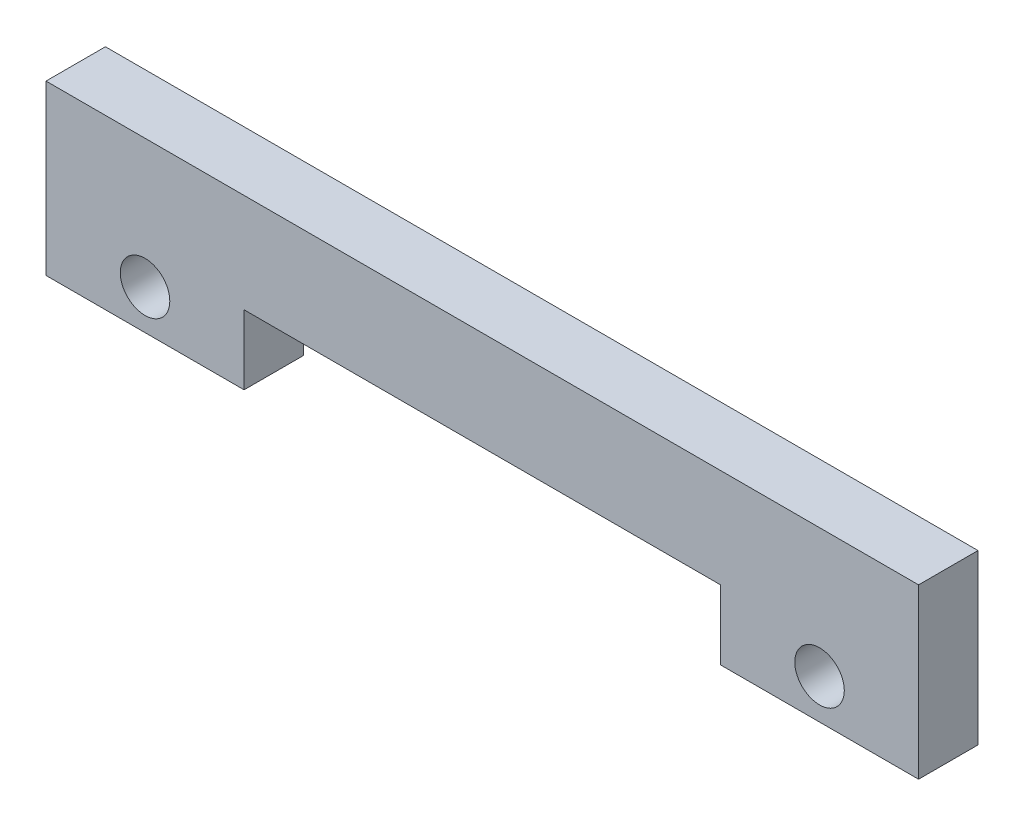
ISO-10303-21;
HEADER;
FILE_DESCRIPTION(('STEP AP214'),'2;1');
FILE_NAME('part.step','',(''),(''),'','','');
FILE_SCHEMA(('AUTOMOTIVE_DESIGN { 1 0 10303 214 1 1 1 1 }'));
ENDSEC;
DATA;
#1=APPLICATION_CONTEXT('core data for automotive mechanical design processes');
#2=APPLICATION_PROTOCOL_DEFINITION('international standard','automotive_design',2000,#1);
#3=PRODUCT_CONTEXT('',#1,'mechanical');
#4=PRODUCT('Part','Part','',(#3));
#5=PRODUCT_RELATED_PRODUCT_CATEGORY('part','',(#4));
#6=PRODUCT_DEFINITION_FORMATION('','',#4);
#7=PRODUCT_DEFINITION_CONTEXT('part definition',#1,'design');
#8=PRODUCT_DEFINITION('design','',#6,#7);
#9=PRODUCT_DEFINITION_SHAPE('','',#8);
#10=(LENGTH_UNIT() NAMED_UNIT(*) SI_UNIT(.MILLI.,.METRE.));
#11=(NAMED_UNIT(*) PLANE_ANGLE_UNIT() SI_UNIT($,.RADIAN.));
#12=(NAMED_UNIT(*) SI_UNIT($,.STERADIAN.) SOLID_ANGLE_UNIT());
#13=UNCERTAINTY_MEASURE_WITH_UNIT(LENGTH_MEASURE(1.E-05),#10,'distance_accuracy_value','');
#14=(GEOMETRIC_REPRESENTATION_CONTEXT(3) GLOBAL_UNCERTAINTY_ASSIGNED_CONTEXT((#13)) GLOBAL_UNIT_ASSIGNED_CONTEXT((#10,
#11,#12)) REPRESENTATION_CONTEXT('',''));
#15=CARTESIAN_POINT('',(0.,0.,0.));
#16=DIRECTION('',(0.,0.,1.));
#17=DIRECTION('',(1.,0.,0.));
#18=AXIS2_PLACEMENT_3D('',#15,#16,#17);
#19=CARTESIAN_POINT('',(0.,0.,3.));
#20=DIRECTION('',(0.,0.,1.));
#21=DIRECTION('',(1.,0.,0.));
#22=AXIS2_PLACEMENT_3D('',#19,#20,#21);
#23=PLANE('',#22);
#24=CARTESIAN_POINT('',(48.3612622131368,263.707308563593,3.));
#25=DIRECTION('',(0.,0.,1.));
#26=DIRECTION('',(1.,0.,0.));
#27=AXIS2_PLACEMENT_3D('',#24,#25,#26);
#28=CIRCLE('',#27,1.25);
#29=CARTESIAN_POINT('',(49.6112622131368,263.707308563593,3.));
#30=VERTEX_POINT('',#29);
#31=EDGE_CURVE('E133',#30,#30,#28,.T.);
#32=ORIENTED_EDGE('',*,*,#31,.F.);
#33=EDGE_LOOP('',(#32));
#34=FACE_BOUND('',#33,.T.);
#35=DIRECTION('',(1.,0.,0.));
#36=VECTOR('',#35,1.);
#37=CARTESIAN_POINT('',(77.4134354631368,261.707308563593,3.));
#38=LINE('',#37,#36);
#39=CARTESIAN_POINT('',(77.4134354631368,261.707308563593,3.));
#40=VERTEX_POINT('',#39);
#41=CARTESIAN_POINT('',(87.4134354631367,261.707308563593,3.));
#42=VERTEX_POINT('',#41);
#43=EDGE_CURVE('E144',#40,#42,#38,.T.);
#44=ORIENTED_EDGE('',*,*,#43,.T.);
#45=DIRECTION('',(0.,1.,0.));
#46=VECTOR('',#45,1.);
#47=CARTESIAN_POINT('',(87.4134354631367,261.707308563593,3.));
#48=LINE('',#47,#46);
#49=CARTESIAN_POINT('',(87.4134354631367,270.207308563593,3.));
#50=VERTEX_POINT('',#49);
#51=EDGE_CURVE('E92',#42,#50,#48,.T.);
#52=ORIENTED_EDGE('',*,*,#51,.T.);
#53=DIRECTION('',(-1.,0.,0.));
#54=VECTOR('',#53,1.);
#55=CARTESIAN_POINT('',(43.3612622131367,270.207308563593,3.));
#56=LINE('',#55,#54);
#57=CARTESIAN_POINT('',(43.3612622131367,270.207308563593,3.));
#58=VERTEX_POINT('',#57);
#59=EDGE_CURVE('E159',#50,#58,#56,.T.);
#60=ORIENTED_EDGE('',*,*,#59,.T.);
#61=DIRECTION('',(0.,-1.,0.));
#62=VECTOR('',#61,1.);
#63=CARTESIAN_POINT('',(43.3612622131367,261.707308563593,3.));
#64=LINE('',#63,#62);
#65=CARTESIAN_POINT('',(43.3612622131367,261.707308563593,3.));
#66=VERTEX_POINT('',#65);
#67=EDGE_CURVE('E172',#58,#66,#64,.T.);
#68=ORIENTED_EDGE('',*,*,#67,.T.);
#69=DIRECTION('',(1.,0.,0.));
#70=VECTOR('',#69,1.);
#71=CARTESIAN_POINT('',(43.3612622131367,261.707308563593,3.));
#72=LINE('',#71,#70);
#73=CARTESIAN_POINT('',(53.3612622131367,261.707308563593,3.));
#74=VERTEX_POINT('',#73);
#75=EDGE_CURVE('E111',#66,#74,#72,.T.);
#76=ORIENTED_EDGE('',*,*,#75,.T.);
#77=DIRECTION('',(0.,1.,0.));
#78=VECTOR('',#77,1.);
#79=CARTESIAN_POINT('',(53.3612622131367,261.707308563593,3.));
#80=LINE('',#79,#78);
#81=CARTESIAN_POINT('',(53.3612622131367,265.207308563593,3.));
#82=VERTEX_POINT('',#81);
#83=EDGE_CURVE('E105',#74,#82,#80,.T.);
#84=ORIENTED_EDGE('',*,*,#83,.T.);
#85=DIRECTION('',(1.,0.,0.));
#86=VECTOR('',#85,1.);
#87=CARTESIAN_POINT('',(77.4134354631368,265.207308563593,3.));
#88=LINE('',#87,#86);
#89=CARTESIAN_POINT('',(77.4134354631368,265.207308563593,3.));
#90=VERTEX_POINT('',#89);
#91=EDGE_CURVE('E109',#82,#90,#88,.T.);
#92=ORIENTED_EDGE('',*,*,#91,.T.);
#93=DIRECTION('',(0.,-1.,0.));
#94=VECTOR('',#93,1.);
#95=CARTESIAN_POINT('',(77.4134354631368,261.707308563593,3.));
#96=LINE('',#95,#94);
#97=EDGE_CURVE('E49',#90,#40,#96,.T.);
#98=ORIENTED_EDGE('',*,*,#97,.T.);
#99=EDGE_LOOP('',(#44,#52,#60,#68,#76,#84,#92,#98));
#100=FACE_BOUND('',#99,.T.);
#101=CARTESIAN_POINT('',(82.4134354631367,263.707308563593,3.));
#102=DIRECTION('',(0.,0.,1.));
#103=DIRECTION('',(1.,0.,0.));
#104=AXIS2_PLACEMENT_3D('',#101,#102,#103);
#105=CIRCLE('',#104,1.25);
#106=CARTESIAN_POINT('',(83.6634354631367,263.707308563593,3.));
#107=VERTEX_POINT('',#106);
#108=EDGE_CURVE('E181',#107,#107,#105,.T.);
#109=ORIENTED_EDGE('',*,*,#108,.F.);
#110=EDGE_LOOP('',(#109));
#111=FACE_BOUND('',#110,.T.);
#112=ADVANCED_FACE('F32',(#34,#100,#111),#23,.T.);
#113=CARTESIAN_POINT('',(0.,0.,0.));
#114=DIRECTION('',(0.,0.,1.));
#115=DIRECTION('',(1.,0.,0.));
#116=AXIS2_PLACEMENT_3D('',#113,#114,#115);
#117=PLANE('',#116);
#118=DIRECTION('',(1.,0.,0.));
#119=VECTOR('',#118,1.);
#120=CARTESIAN_POINT('',(77.4134354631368,261.707308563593,0.));
#121=LINE('',#120,#119);
#122=CARTESIAN_POINT('',(77.4134354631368,261.707308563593,0.));
#123=VERTEX_POINT('',#122);
#124=CARTESIAN_POINT('',(87.4134354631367,261.707308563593,0.));
#125=VERTEX_POINT('',#124);
#126=EDGE_CURVE('E129',#123,#125,#121,.T.);
#127=ORIENTED_EDGE('',*,*,#126,.F.);
#128=DIRECTION('',(0.,-1.,0.));
#129=VECTOR('',#128,1.);
#130=CARTESIAN_POINT('',(77.4134354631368,261.707308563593,0.));
#131=LINE('',#130,#129);
#132=CARTESIAN_POINT('',(77.4134354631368,265.207308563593,0.));
#133=VERTEX_POINT('',#132);
#134=EDGE_CURVE('E84',#133,#123,#131,.T.);
#135=ORIENTED_EDGE('',*,*,#134,.F.);
#136=DIRECTION('',(1.,0.,0.));
#137=VECTOR('',#136,1.);
#138=CARTESIAN_POINT('',(77.4134354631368,265.207308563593,0.));
#139=LINE('',#138,#137);
#140=CARTESIAN_POINT('',(53.3612622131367,265.207308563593,0.));
#141=VERTEX_POINT('',#140);
#142=EDGE_CURVE('E78',#141,#133,#139,.T.);
#143=ORIENTED_EDGE('',*,*,#142,.F.);
#144=DIRECTION('',(0.,1.,0.));
#145=VECTOR('',#144,1.);
#146=CARTESIAN_POINT('',(53.3612622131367,261.707308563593,0.));
#147=LINE('',#146,#145);
#148=CARTESIAN_POINT('',(53.3612622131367,261.707308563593,0.));
#149=VERTEX_POINT('',#148);
#150=EDGE_CURVE('E119',#149,#141,#147,.T.);
#151=ORIENTED_EDGE('',*,*,#150,.F.);
#152=DIRECTION('',(1.,0.,0.));
#153=VECTOR('',#152,1.);
#154=CARTESIAN_POINT('',(43.3612622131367,261.707308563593,0.));
#155=LINE('',#154,#153);
#156=CARTESIAN_POINT('',(43.3612622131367,261.707308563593,0.));
#157=VERTEX_POINT('',#156);
#158=EDGE_CURVE('E139',#157,#149,#155,.T.);
#159=ORIENTED_EDGE('',*,*,#158,.F.);
#160=DIRECTION('',(0.,-1.,0.));
#161=VECTOR('',#160,1.);
#162=CARTESIAN_POINT('',(43.3612622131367,261.707308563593,0.));
#163=LINE('',#162,#161);
#164=CARTESIAN_POINT('',(43.3612622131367,270.207308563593,0.));
#165=VERTEX_POINT('',#164);
#166=EDGE_CURVE('E137',#165,#157,#163,.T.);
#167=ORIENTED_EDGE('',*,*,#166,.F.);
#168=DIRECTION('',(-1.,0.,0.));
#169=VECTOR('',#168,1.);
#170=CARTESIAN_POINT('',(43.3612622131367,270.207308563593,0.));
#171=LINE('',#170,#169);
#172=CARTESIAN_POINT('',(87.4134354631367,270.207308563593,0.));
#173=VERTEX_POINT('',#172);
#174=EDGE_CURVE('E135',#173,#165,#171,.T.);
#175=ORIENTED_EDGE('',*,*,#174,.F.);
#176=DIRECTION('',(0.,1.,0.));
#177=VECTOR('',#176,1.);
#178=CARTESIAN_POINT('',(87.4134354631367,261.707308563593,0.));
#179=LINE('',#178,#177);
#180=EDGE_CURVE('E132',#125,#173,#179,.T.);
#181=ORIENTED_EDGE('',*,*,#180,.F.);
#182=EDGE_LOOP('',(#127,#135,#143,#151,#159,#167,#175,#181));
#183=FACE_BOUND('',#182,.T.);
#184=CARTESIAN_POINT('',(48.3612622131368,263.707308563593,0.));
#185=DIRECTION('',(0.,0.,1.));
#186=DIRECTION('',(1.,0.,0.));
#187=AXIS2_PLACEMENT_3D('',#184,#185,#186);
#188=CIRCLE('',#187,1.25);
#189=CARTESIAN_POINT('',(49.6112622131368,263.707308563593,0.));
#190=VERTEX_POINT('',#189);
#191=EDGE_CURVE('E178',#190,#190,#188,.T.);
#192=ORIENTED_EDGE('',*,*,#191,.T.);
#193=EDGE_LOOP('',(#192));
#194=FACE_BOUND('',#193,.T.);
#195=CARTESIAN_POINT('',(82.4134354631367,263.707308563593,0.));
#196=DIRECTION('',(0.,0.,1.));
#197=DIRECTION('',(1.,0.,0.));
#198=AXIS2_PLACEMENT_3D('',#195,#196,#197);
#199=CIRCLE('',#198,1.25);
#200=CARTESIAN_POINT('',(83.6634354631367,263.707308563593,0.));
#201=VERTEX_POINT('',#200);
#202=EDGE_CURVE('E184',#201,#201,#199,.T.);
#203=ORIENTED_EDGE('',*,*,#202,.T.);
#204=EDGE_LOOP('',(#203));
#205=FACE_BOUND('',#204,.T.);
#206=ADVANCED_FACE('F163',(#183,#194,#205),#117,.F.);
#207=CARTESIAN_POINT('',(77.4134354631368,261.707308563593,3.));
#208=DIRECTION('',(0.,1.,0.));
#209=DIRECTION('',(0.,0.,1.));
#210=AXIS2_PLACEMENT_3D('',#207,#208,#209);
#211=PLANE('',#210);
#212=ORIENTED_EDGE('',*,*,#126,.T.);
#213=DIRECTION('',(0.,0.,-1.));
#214=VECTOR('',#213,1.);
#215=CARTESIAN_POINT('',(87.4134354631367,261.707308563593,3.));
#216=LINE('',#215,#214);
#217=EDGE_CURVE('E11',#42,#125,#216,.T.);
#218=ORIENTED_EDGE('',*,*,#217,.F.);
#219=ORIENTED_EDGE('',*,*,#43,.F.);
#220=DIRECTION('',(0.,0.,-1.));
#221=VECTOR('',#220,1.);
#222=CARTESIAN_POINT('',(77.4134354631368,261.707308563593,3.));
#223=LINE('',#222,#221);
#224=EDGE_CURVE('E125',#40,#123,#223,.T.);
#225=ORIENTED_EDGE('',*,*,#224,.T.);
#226=EDGE_LOOP('',(#212,#218,#219,#225));
#227=FACE_BOUND('',#226,.T.);
#228=ADVANCED_FACE('F34',(#227),#211,.F.);
#229=CARTESIAN_POINT('',(87.4134354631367,261.707308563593,3.));
#230=DIRECTION('',(-1.,0.,0.));
#231=DIRECTION('',(0.,0.,1.));
#232=AXIS2_PLACEMENT_3D('',#229,#230,#231);
#233=PLANE('',#232);
#234=ORIENTED_EDGE('',*,*,#180,.T.);
#235=DIRECTION('',(0.,0.,-1.));
#236=VECTOR('',#235,1.);
#237=CARTESIAN_POINT('',(87.4134354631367,270.207308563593,3.));
#238=LINE('',#237,#236);
#239=EDGE_CURVE('E41',#50,#173,#238,.T.);
#240=ORIENTED_EDGE('',*,*,#239,.F.);
#241=ORIENTED_EDGE('',*,*,#51,.F.);
#242=ORIENTED_EDGE('',*,*,#217,.T.);
#243=EDGE_LOOP('',(#234,#240,#241,#242));
#244=FACE_BOUND('',#243,.T.);
#245=ADVANCED_FACE('F216',(#244),#233,.F.);
#246=CARTESIAN_POINT('',(43.3612622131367,270.207308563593,3.));
#247=DIRECTION('',(0.,-1.,0.));
#248=DIRECTION('',(0.,0.,-1.));
#249=AXIS2_PLACEMENT_3D('',#246,#247,#248);
#250=PLANE('',#249);
#251=ORIENTED_EDGE('',*,*,#174,.T.);
#252=DIRECTION('',(0.,0.,-1.));
#253=VECTOR('',#252,1.);
#254=CARTESIAN_POINT('',(43.3612622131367,270.207308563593,3.));
#255=LINE('',#254,#253);
#256=EDGE_CURVE('E151',#58,#165,#255,.T.);
#257=ORIENTED_EDGE('',*,*,#256,.F.);
#258=ORIENTED_EDGE('',*,*,#59,.F.);
#259=ORIENTED_EDGE('',*,*,#239,.T.);
#260=EDGE_LOOP('',(#251,#257,#258,#259));
#261=FACE_BOUND('',#260,.T.);
#262=ADVANCED_FACE('F157',(#261),#250,.F.);
#263=CARTESIAN_POINT('',(43.3612622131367,261.707308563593,3.));
#264=DIRECTION('',(1.,0.,0.));
#265=DIRECTION('',(0.,0.,-1.));
#266=AXIS2_PLACEMENT_3D('',#263,#264,#265);
#267=PLANE('',#266);
#268=ORIENTED_EDGE('',*,*,#166,.T.);
#269=DIRECTION('',(0.,0.,-1.));
#270=VECTOR('',#269,1.);
#271=CARTESIAN_POINT('',(43.3612622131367,261.707308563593,3.));
#272=LINE('',#271,#270);
#273=EDGE_CURVE('E148',#66,#157,#272,.T.);
#274=ORIENTED_EDGE('',*,*,#273,.F.);
#275=ORIENTED_EDGE('',*,*,#67,.F.);
#276=ORIENTED_EDGE('',*,*,#256,.T.);
#277=EDGE_LOOP('',(#268,#274,#275,#276));
#278=FACE_BOUND('',#277,.T.);
#279=ADVANCED_FACE('F168',(#278),#267,.F.);
#280=CARTESIAN_POINT('',(43.3612622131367,261.707308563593,3.));
#281=DIRECTION('',(0.,1.,0.));
#282=DIRECTION('',(0.,0.,1.));
#283=AXIS2_PLACEMENT_3D('',#280,#281,#282);
#284=PLANE('',#283);
#285=ORIENTED_EDGE('',*,*,#158,.T.);
#286=DIRECTION('',(0.,0.,-1.));
#287=VECTOR('',#286,1.);
#288=CARTESIAN_POINT('',(53.3612622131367,261.707308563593,3.));
#289=LINE('',#288,#287);
#290=EDGE_CURVE('E120',#74,#149,#289,.T.);
#291=ORIENTED_EDGE('',*,*,#290,.F.);
#292=ORIENTED_EDGE('',*,*,#75,.F.);
#293=ORIENTED_EDGE('',*,*,#273,.T.);
#294=EDGE_LOOP('',(#285,#291,#292,#293));
#295=FACE_BOUND('',#294,.T.);
#296=ADVANCED_FACE('F171',(#295),#284,.F.);
#297=CARTESIAN_POINT('',(53.3612622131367,261.707308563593,3.));
#298=DIRECTION('',(-1.,0.,0.));
#299=DIRECTION('',(0.,0.,1.));
#300=AXIS2_PLACEMENT_3D('',#297,#298,#299);
#301=PLANE('',#300);
#302=ORIENTED_EDGE('',*,*,#150,.T.);
#303=DIRECTION('',(0.,0.,-1.));
#304=VECTOR('',#303,1.);
#305=CARTESIAN_POINT('',(53.3612622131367,265.207308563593,3.));
#306=LINE('',#305,#304);
#307=EDGE_CURVE('E116',#82,#141,#306,.T.);
#308=ORIENTED_EDGE('',*,*,#307,.F.);
#309=ORIENTED_EDGE('',*,*,#83,.F.);
#310=ORIENTED_EDGE('',*,*,#290,.T.);
#311=EDGE_LOOP('',(#302,#308,#309,#310));
#312=FACE_BOUND('',#311,.T.);
#313=ADVANCED_FACE('F117',(#312),#301,.F.);
#314=CARTESIAN_POINT('',(77.4134354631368,265.207308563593,3.));
#315=DIRECTION('',(0.,1.,0.));
#316=DIRECTION('',(0.,0.,1.));
#317=AXIS2_PLACEMENT_3D('',#314,#315,#316);
#318=PLANE('',#317);
#319=ORIENTED_EDGE('',*,*,#142,.T.);
#320=DIRECTION('',(0.,0.,-1.));
#321=VECTOR('',#320,1.);
#322=CARTESIAN_POINT('',(77.4134354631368,265.207308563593,3.));
#323=LINE('',#322,#321);
#324=EDGE_CURVE('E121',#90,#133,#323,.T.);
#325=ORIENTED_EDGE('',*,*,#324,.F.);
#326=ORIENTED_EDGE('',*,*,#91,.F.);
#327=ORIENTED_EDGE('',*,*,#307,.T.);
#328=EDGE_LOOP('',(#319,#325,#326,#327));
#329=FACE_BOUND('',#328,.T.);
#330=ADVANCED_FACE('F123',(#329),#318,.F.);
#331=CARTESIAN_POINT('',(77.4134354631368,261.707308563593,3.));
#332=DIRECTION('',(1.,0.,0.));
#333=DIRECTION('',(0.,1.,0.));
#334=AXIS2_PLACEMENT_3D('',#331,#332,#333);
#335=PLANE('',#334);
#336=ORIENTED_EDGE('',*,*,#134,.T.);
#337=ORIENTED_EDGE('',*,*,#224,.F.);
#338=ORIENTED_EDGE('',*,*,#97,.F.);
#339=ORIENTED_EDGE('',*,*,#324,.T.);
#340=EDGE_LOOP('',(#336,#337,#338,#339));
#341=FACE_BOUND('',#340,.T.);
#342=ADVANCED_FACE('F204',(#341),#335,.F.);
#343=CARTESIAN_POINT('',(48.3612622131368,263.707308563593,3.));
#344=DIRECTION('',(0.,0.,-1.));
#345=DIRECTION('',(-1.,0.,0.));
#346=AXIS2_PLACEMENT_3D('',#343,#344,#345);
#347=CYLINDRICAL_SURFACE('',#346,1.25);
#348=ORIENTED_EDGE('',*,*,#31,.T.);
#349=EDGE_LOOP('',(#348));
#350=FACE_BOUND('',#349,.T.);
#351=ORIENTED_EDGE('',*,*,#191,.F.);
#352=EDGE_LOOP('',(#351));
#353=FACE_BOUND('',#352,.T.);
#354=ADVANCED_FACE('F201',(#350,#353),#347,.F.);
#355=CARTESIAN_POINT('',(82.4134354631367,263.707308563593,3.));
#356=DIRECTION('',(0.,0.,-1.));
#357=DIRECTION('',(-1.,0.,0.));
#358=AXIS2_PLACEMENT_3D('',#355,#356,#357);
#359=CYLINDRICAL_SURFACE('',#358,1.25);
#360=ORIENTED_EDGE('',*,*,#108,.T.);
#361=EDGE_LOOP('',(#360));
#362=FACE_BOUND('',#361,.T.);
#363=ORIENTED_EDGE('',*,*,#202,.F.);
#364=EDGE_LOOP('',(#363));
#365=FACE_BOUND('',#364,.T.);
#366=ADVANCED_FACE('F190',(#362,#365),#359,.F.);
#367=CLOSED_SHELL('',(#112,#206,#228,#245,#262,#279,#296,#313,#330,#342,#354,#366));
#368=MANIFOLD_SOLID_BREP('B2',#367);
#369=ADVANCED_BREP_SHAPE_REPRESENTATION('',(#18,#368),#14);
#370=SHAPE_DEFINITION_REPRESENTATION(#9,#369);
ENDSEC;
END-ISO-10303-21;
